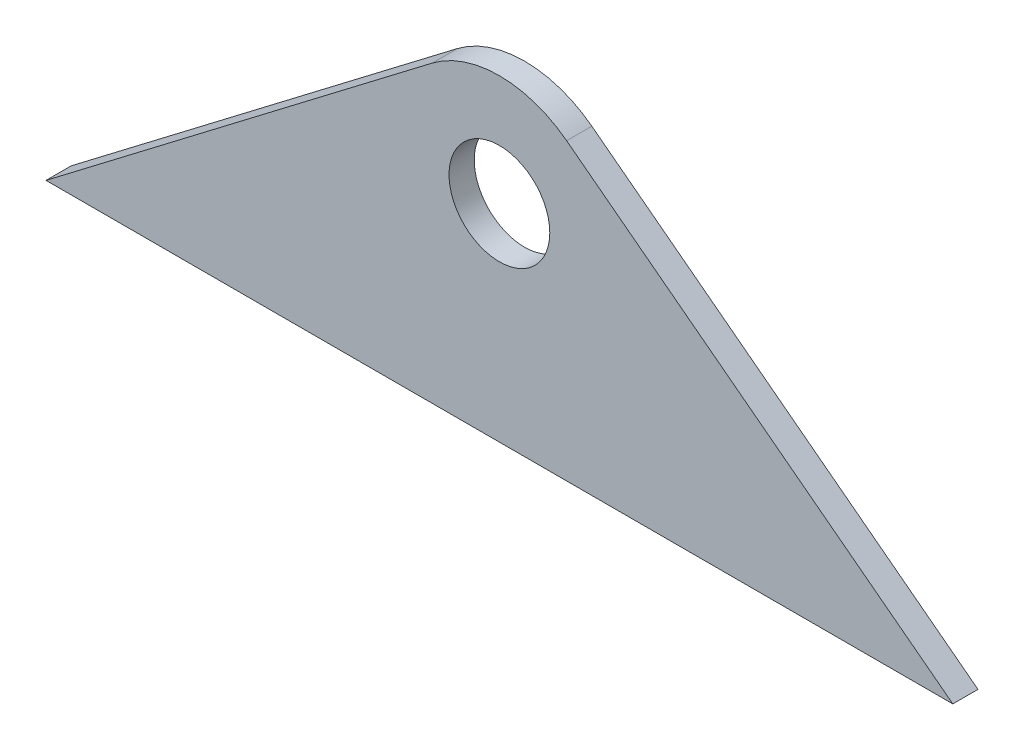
ISO-10303-21;
HEADER;
FILE_DESCRIPTION(('STEP AP214'),'2;1');
FILE_NAME('part.step','',(''),(''),'','','');
FILE_SCHEMA(('AUTOMOTIVE_DESIGN { 1 0 10303 214 1 1 1 1 }'));
ENDSEC;
DATA;
#1=APPLICATION_CONTEXT('core data for automotive mechanical design processes');
#2=APPLICATION_PROTOCOL_DEFINITION('international standard','automotive_design',2000,#1);
#3=PRODUCT_CONTEXT('',#1,'mechanical');
#4=PRODUCT('Part','Part','',(#3));
#5=PRODUCT_RELATED_PRODUCT_CATEGORY('part','',(#4));
#6=PRODUCT_DEFINITION_FORMATION('','',#4);
#7=PRODUCT_DEFINITION_CONTEXT('part definition',#1,'design');
#8=PRODUCT_DEFINITION('design','',#6,#7);
#9=PRODUCT_DEFINITION_SHAPE('','',#8);
#10=(LENGTH_UNIT() NAMED_UNIT(*) SI_UNIT(.MILLI.,.METRE.));
#11=(NAMED_UNIT(*) PLANE_ANGLE_UNIT() SI_UNIT($,.RADIAN.));
#12=(NAMED_UNIT(*) SI_UNIT($,.STERADIAN.) SOLID_ANGLE_UNIT());
#13=UNCERTAINTY_MEASURE_WITH_UNIT(LENGTH_MEASURE(1.E-05),#10,'distance_accuracy_value','');
#14=(GEOMETRIC_REPRESENTATION_CONTEXT(3) GLOBAL_UNCERTAINTY_ASSIGNED_CONTEXT((#13)) GLOBAL_UNIT_ASSIGNED_CONTEXT((#10,
#11,#12)) REPRESENTATION_CONTEXT('',''));
#15=CARTESIAN_POINT('',(0.,0.,0.));
#16=DIRECTION('',(0.,0.,1.));
#17=DIRECTION('',(1.,0.,0.));
#18=AXIS2_PLACEMENT_3D('',#15,#16,#17);
#19=CARTESIAN_POINT('',(0.,0.,5.));
#20=DIRECTION('',(0.,0.,1.));
#21=DIRECTION('',(1.,0.,0.));
#22=AXIS2_PLACEMENT_3D('',#19,#20,#21);
#23=PLANE('',#22);
#24=DIRECTION('',(-0.794999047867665,-0.606610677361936,0.));
#25=VECTOR('',#24,1.);
#26=CARTESIAN_POINT('',(-13.3454349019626,17.4899790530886,5.));
#27=LINE('',#26,#25);
#28=CARTESIAN_POINT('',(-13.3454349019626,17.4899790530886,5.));
#29=VERTEX_POINT('',#28);
#30=CARTESIAN_POINT('',(-90.,-41.,5.));
#31=VERTEX_POINT('',#30);
#32=EDGE_CURVE('E99',#29,#31,#27,.T.);
#33=ORIENTED_EDGE('',*,*,#32,.T.);
#34=DIRECTION('',(1.,0.,0.));
#35=VECTOR('',#34,1.);
#36=CARTESIAN_POINT('',(-90.,-41.,5.));
#37=LINE('',#36,#35);
#38=CARTESIAN_POINT('',(90.,-41.,5.));
#39=VERTEX_POINT('',#38);
#40=EDGE_CURVE('E84',#31,#39,#37,.T.);
#41=ORIENTED_EDGE('',*,*,#40,.T.);
#42=DIRECTION('',(-0.794999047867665,0.606610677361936,0.));
#43=VECTOR('',#42,1.);
#44=CARTESIAN_POINT('',(90.,-41.,5.));
#45=LINE('',#44,#43);
#46=CARTESIAN_POINT('',(13.3454349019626,17.4899790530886,5.));
#47=VERTEX_POINT('',#46);
#48=EDGE_CURVE('E50',#39,#47,#45,.T.);
#49=ORIENTED_EDGE('',*,*,#48,.T.);
#50=CARTESIAN_POINT('',(0.,0.,5.));
#51=DIRECTION('',(0.,0.,1.));
#52=DIRECTION('',(1.,0.,0.));
#53=AXIS2_PLACEMENT_3D('',#50,#51,#52);
#54=CIRCLE('',#53,22.);
#55=EDGE_CURVE('E45',#47,#29,#54,.T.);
#56=ORIENTED_EDGE('',*,*,#55,.T.);
#57=EDGE_LOOP('',(#33,#41,#49,#56));
#58=FACE_BOUND('',#57,.T.);
#59=CARTESIAN_POINT('',(0.,0.,5.));
#60=DIRECTION('',(0.,0.,1.));
#61=DIRECTION('',(1.,0.,0.));
#62=AXIS2_PLACEMENT_3D('',#59,#60,#61);
#63=CIRCLE('',#62,10.);
#64=CARTESIAN_POINT('',(10.,0.,5.));
#65=VERTEX_POINT('',#64);
#66=EDGE_CURVE('E89',#65,#65,#63,.T.);
#67=ORIENTED_EDGE('',*,*,#66,.F.);
#68=EDGE_LOOP('',(#67));
#69=FACE_BOUND('',#68,.T.);
#70=ADVANCED_FACE('F30',(#58,#69),#23,.T.);
#71=CARTESIAN_POINT('',(0.,0.,0.));
#72=DIRECTION('',(0.,0.,1.));
#73=DIRECTION('',(1.,0.,0.));
#74=AXIS2_PLACEMENT_3D('',#71,#72,#73);
#75=PLANE('',#74);
#76=DIRECTION('',(-0.794999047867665,-0.606610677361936,0.));
#77=VECTOR('',#76,1.);
#78=CARTESIAN_POINT('',(-13.3454349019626,17.4899790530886,0.));
#79=LINE('',#78,#77);
#80=CARTESIAN_POINT('',(-13.3454349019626,17.4899790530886,0.));
#81=VERTEX_POINT('',#80);
#82=CARTESIAN_POINT('',(-90.,-41.,0.));
#83=VERTEX_POINT('',#82);
#84=EDGE_CURVE('E76',#81,#83,#79,.T.);
#85=ORIENTED_EDGE('',*,*,#84,.F.);
#86=CARTESIAN_POINT('',(0.,0.,0.));
#87=DIRECTION('',(0.,0.,1.));
#88=DIRECTION('',(1.,0.,0.));
#89=AXIS2_PLACEMENT_3D('',#86,#87,#88);
#90=CIRCLE('',#89,22.);
#91=CARTESIAN_POINT('',(13.3454349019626,17.4899790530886,0.));
#92=VERTEX_POINT('',#91);
#93=EDGE_CURVE('E97',#92,#81,#90,.T.);
#94=ORIENTED_EDGE('',*,*,#93,.F.);
#95=DIRECTION('',(-0.794999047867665,0.606610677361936,0.));
#96=VECTOR('',#95,1.);
#97=CARTESIAN_POINT('',(90.,-41.,0.));
#98=LINE('',#97,#96);
#99=CARTESIAN_POINT('',(90.,-41.,0.));
#100=VERTEX_POINT('',#99);
#101=EDGE_CURVE('E77',#100,#92,#98,.T.);
#102=ORIENTED_EDGE('',*,*,#101,.F.);
#103=DIRECTION('',(1.,0.,0.));
#104=VECTOR('',#103,1.);
#105=CARTESIAN_POINT('',(-90.,-41.,0.));
#106=LINE('',#105,#104);
#107=EDGE_CURVE('E71',#83,#100,#106,.T.);
#108=ORIENTED_EDGE('',*,*,#107,.F.);
#109=EDGE_LOOP('',(#85,#94,#102,#108));
#110=FACE_BOUND('',#109,.T.);
#111=CARTESIAN_POINT('',(0.,0.,0.));
#112=DIRECTION('',(0.,0.,1.));
#113=DIRECTION('',(1.,0.,0.));
#114=AXIS2_PLACEMENT_3D('',#111,#112,#113);
#115=CIRCLE('',#114,10.);
#116=CARTESIAN_POINT('',(10.,0.,0.));
#117=VERTEX_POINT('',#116);
#118=EDGE_CURVE('E92',#117,#117,#115,.T.);
#119=ORIENTED_EDGE('',*,*,#118,.T.);
#120=EDGE_LOOP('',(#119));
#121=FACE_BOUND('',#120,.T.);
#122=ADVANCED_FACE('F72',(#110,#121),#75,.F.);
#123=CARTESIAN_POINT('',(-13.3454349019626,17.4899790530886,5.));
#124=DIRECTION('',(0.606610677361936,-0.794999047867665,0.));
#125=DIRECTION('',(0.794999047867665,0.606610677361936,0.));
#126=AXIS2_PLACEMENT_3D('',#123,#124,#125);
#127=PLANE('',#126);
#128=ORIENTED_EDGE('',*,*,#84,.T.);
#129=DIRECTION('',(0.,0.,-1.));
#130=VECTOR('',#129,1.);
#131=CARTESIAN_POINT('',(-90.,-41.,5.));
#132=LINE('',#131,#130);
#133=EDGE_CURVE('E11',#31,#83,#132,.T.);
#134=ORIENTED_EDGE('',*,*,#133,.F.);
#135=ORIENTED_EDGE('',*,*,#32,.F.);
#136=DIRECTION('',(0.,0.,-1.));
#137=VECTOR('',#136,1.);
#138=CARTESIAN_POINT('',(-13.3454349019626,17.4899790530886,5.));
#139=LINE('',#138,#137);
#140=EDGE_CURVE('E88',#29,#81,#139,.T.);
#141=ORIENTED_EDGE('',*,*,#140,.T.);
#142=EDGE_LOOP('',(#128,#134,#135,#141));
#143=FACE_BOUND('',#142,.T.);
#144=ADVANCED_FACE('F32',(#143),#127,.F.);
#145=CARTESIAN_POINT('',(-90.,-41.,5.));
#146=DIRECTION('',(0.,1.,0.));
#147=DIRECTION('',(-1.,0.,0.));
#148=AXIS2_PLACEMENT_3D('',#145,#146,#147);
#149=PLANE('',#148);
#150=ORIENTED_EDGE('',*,*,#107,.T.);
#151=DIRECTION('',(0.,0.,-1.));
#152=VECTOR('',#151,1.);
#153=CARTESIAN_POINT('',(90.,-41.,5.));
#154=LINE('',#153,#152);
#155=EDGE_CURVE('E38',#39,#100,#154,.T.);
#156=ORIENTED_EDGE('',*,*,#155,.F.);
#157=ORIENTED_EDGE('',*,*,#40,.F.);
#158=ORIENTED_EDGE('',*,*,#133,.T.);
#159=EDGE_LOOP('',(#150,#156,#157,#158));
#160=FACE_BOUND('',#159,.T.);
#161=ADVANCED_FACE('F83',(#160),#149,.F.);
#162=CARTESIAN_POINT('',(90.,-41.,5.));
#163=DIRECTION('',(-0.606610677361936,-0.794999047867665,0.));
#164=DIRECTION('',(0.794999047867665,-0.606610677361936,0.));
#165=AXIS2_PLACEMENT_3D('',#162,#163,#164);
#166=PLANE('',#165);
#167=ORIENTED_EDGE('',*,*,#101,.T.);
#168=DIRECTION('',(0.,0.,-1.));
#169=VECTOR('',#168,1.);
#170=CARTESIAN_POINT('',(13.3454349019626,17.4899790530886,5.));
#171=LINE('',#170,#169);
#172=EDGE_CURVE('E105',#47,#92,#171,.T.);
#173=ORIENTED_EDGE('',*,*,#172,.F.);
#174=ORIENTED_EDGE('',*,*,#48,.F.);
#175=ORIENTED_EDGE('',*,*,#155,.T.);
#176=EDGE_LOOP('',(#167,#173,#174,#175));
#177=FACE_BOUND('',#176,.T.);
#178=ADVANCED_FACE('F108',(#177),#166,.F.);
#179=CARTESIAN_POINT('',(0.,0.,5.));
#180=DIRECTION('',(0.,0.,-1.));
#181=DIRECTION('',(-1.,0.,0.));
#182=AXIS2_PLACEMENT_3D('',#179,#180,#181);
#183=CYLINDRICAL_SURFACE('',#182,22.);
#184=ORIENTED_EDGE('',*,*,#93,.T.);
#185=ORIENTED_EDGE('',*,*,#140,.F.);
#186=ORIENTED_EDGE('',*,*,#55,.F.);
#187=ORIENTED_EDGE('',*,*,#172,.T.);
#188=EDGE_LOOP('',(#184,#185,#186,#187));
#189=FACE_BOUND('',#188,.T.);
#190=ADVANCED_FACE('F110',(#189),#183,.T.);
#191=CARTESIAN_POINT('',(0.,0.,5.));
#192=DIRECTION('',(0.,0.,-1.));
#193=DIRECTION('',(-1.,0.,0.));
#194=AXIS2_PLACEMENT_3D('',#191,#192,#193);
#195=CYLINDRICAL_SURFACE('',#194,10.);
#196=ORIENTED_EDGE('',*,*,#66,.T.);
#197=EDGE_LOOP('',(#196));
#198=FACE_BOUND('',#197,.T.);
#199=ORIENTED_EDGE('',*,*,#118,.F.);
#200=EDGE_LOOP('',(#199));
#201=FACE_BOUND('',#200,.T.);
#202=ADVANCED_FACE('F116',(#198,#201),#195,.F.);
#203=CLOSED_SHELL('',(#70,#122,#144,#161,#178,#190,#202));
#204=MANIFOLD_SOLID_BREP('B2',#203);
#205=ADVANCED_BREP_SHAPE_REPRESENTATION('',(#18,#204),#14);
#206=SHAPE_DEFINITION_REPRESENTATION(#9,#205);
ENDSEC;
END-ISO-10303-21;
